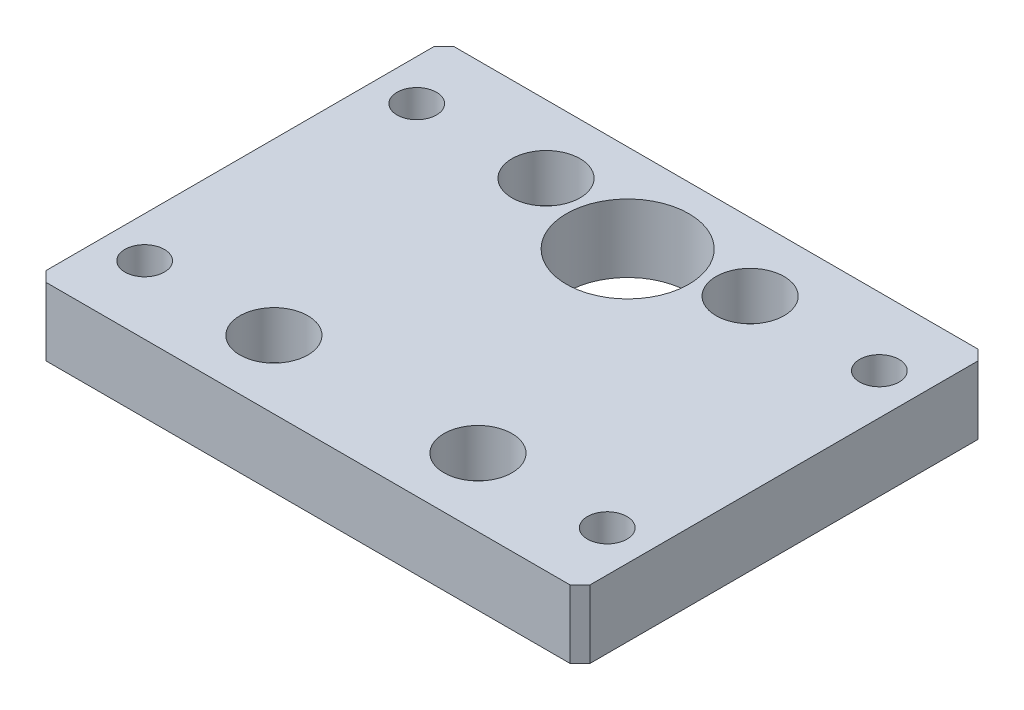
from build123d import *

# Parameters (mm, degrees)
SKETCH_1_W          = 80
SKETCH_1_H          = 60
SKETCH_1_R          = 2.9
SKETCH_1_R_2        = 9
EXTRUDE_1_DEPTH     = 10
SKETCH_2_R          = 5
CUT_EXTRUDE_1_DEPTH = 7
CHAMFER_1_SIZE      = 1.5


with BuildPart() as part:
    # Sketch 1 → Extrude 1 (new body)
    with BuildSketch(Plane(origin=(0, 0, 0), x_dir=(1, 0, 0), z_dir=(0, 1, 0))):
        Rectangle(SKETCH_1_W, SKETCH_1_H)
        with Locations(Location((-34, 20, 0), (0, 0, 270))):
            Circle(SKETCH_1_R, mode=Mode.SUBTRACT)
        with Locations(Location((-15, 20, 0), (0, 0, 270))):
            Circle(SKETCH_1_R, mode=Mode.SUBTRACT)
        with Locations(Location((15, 20, 0), (0, 0, 90))):
            Circle(SKETCH_1_R, mode=Mode.SUBTRACT)
        with Locations(Location((34, 20, 0), (0, 0, 90))):
            Circle(SKETCH_1_R, mode=Mode.SUBTRACT)
        with Locations(Location((34, -20, 0), (0, 0, 270))):
            Circle(SKETCH_1_R, mode=Mode.SUBTRACT)
        with Locations(Location((15, -20, 0), (0, 0, 270))):
            Circle(SKETCH_1_R, mode=Mode.SUBTRACT)
        with Locations(Location((-15, -20, 0), (0, 0, 90))):
            Circle(SKETCH_1_R, mode=Mode.SUBTRACT)
        with Locations(Location((-34, -20, 0), (0, 0, 90))):
            Circle(SKETCH_1_R, mode=Mode.SUBTRACT)
        with Locations(Location((0, 17, 0), (0, 0, 270))):
            Circle(SKETCH_1_R_2, mode=Mode.SUBTRACT)
    extrude(amount=EXTRUDE_1_DEPTH)

    # Sketch 2 → Cut-Extrude 1 (cut)
    with BuildSketch(Plane(origin=(0, 10, 0), x_dir=(1, 0, 0), z_dir=(0, 1, 0))):
        with Locations(Location((-15, 20, 0), (0, 0, 270))):
            Circle(SKETCH_2_R)
        with Locations(Location((15, 20, 0), (0, 0, 270))):
            Circle(SKETCH_2_R)
        with Locations(Location((15, -20, 0), (0, 0, 270))):
            Circle(SKETCH_2_R)
        with Locations(Location((-15, -20, 0), (0, 0, 270))):
            Circle(SKETCH_2_R)
    extrude(amount=-CUT_EXTRUDE_1_DEPTH, mode=Mode.SUBTRACT)

    # Chamfer 1
    chamfer_1_edges = [part.edges().sort_by_distance(p)[0] for p in [
        (-40, 5, -30),
        (40, 5, -30),
        (40, 5, 30),
        (-40, 5, 30),
    ]]
    chamfer(chamfer_1_edges, length=CHAMFER_1_SIZE)


solid = part.part
